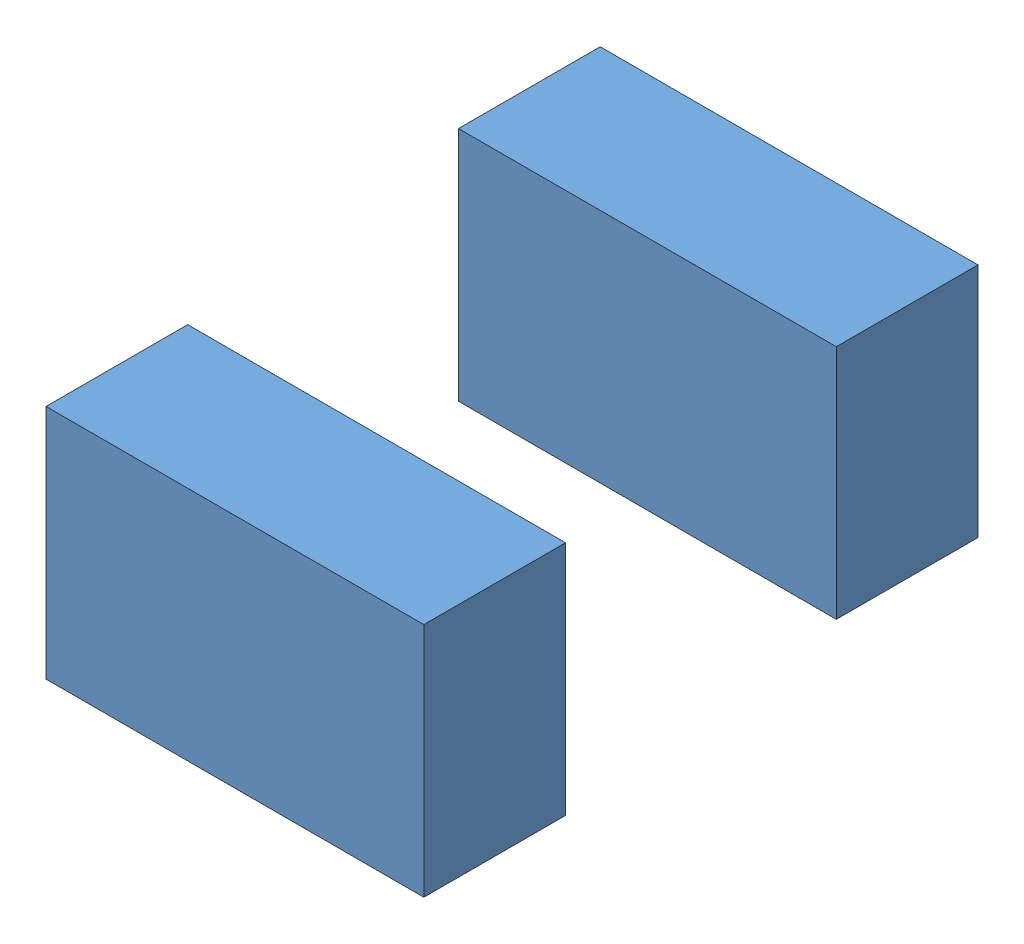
SolidWorks assembly A_Złożenie_symetria.SLDASM, configuration Domyślna (file format 10000). Lengths in mm.
Overall size (87.28 50.01 124.61).
2 component instances, 1 part files, 1 mates.
Components (placement in the parent):
- A_Kostka-1: A_Kostka.SLDPRT [Domyślna] at (-39.3286 -33.3994 32.3052) size (80 50 30)
- A_Kostka-2: A_Kostka.SLDPRT [Domyślna] at (-46.6045 -33.3855 -62.3052) size (80 50 30)
Mates (geometry in assembly coordinates):
- Symetrycznie1: symmetric aligned: plane of A_Kostka-1 through (-39.3286 -33.3994 32.3052) normal (0 0 -1); plane of A_Kostka-2 through (-46.6045 -33.3855 -32.3052) normal (0 0 1); plane of assembly
